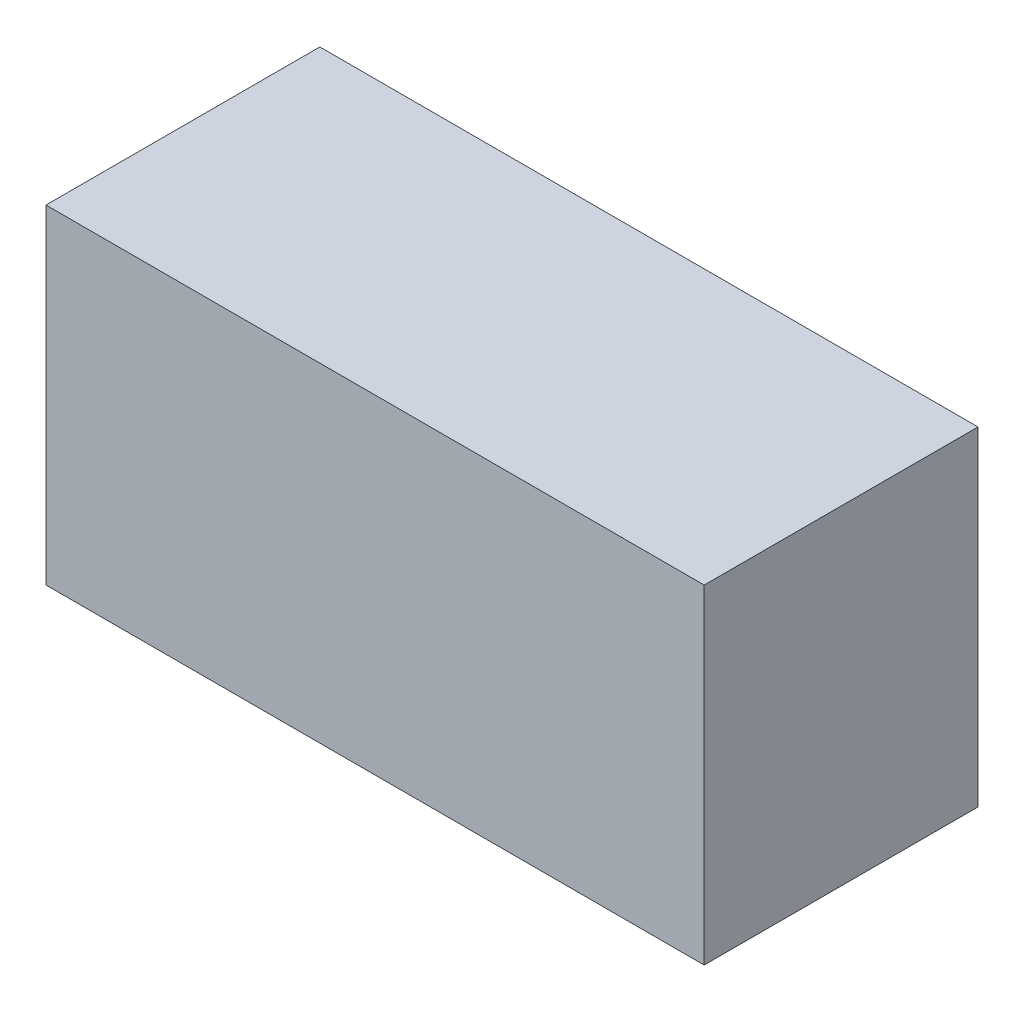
from build123d import *

# Parameters (mm, degrees)
SKETCH1_W           = 254
SKETCH1_H           = 127
BOSS_EXTRUDE1_DEPTH = 105.664


with BuildPart() as part:
    # Sketch1 → Boss-Extrude1 (new body)
    with BuildSketch(Plane.XY):
        Rectangle(SKETCH1_W, SKETCH1_H)
    extrude(amount=BOSS_EXTRUDE1_DEPTH)


solid = part.part
